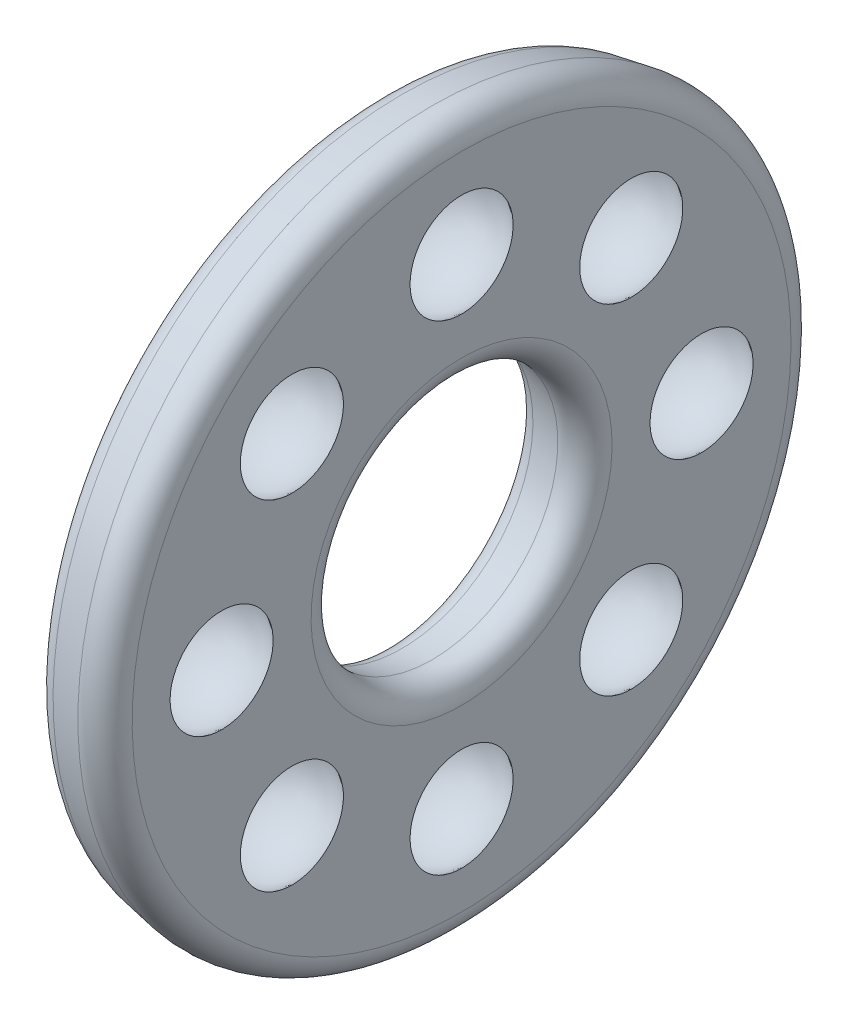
ISO-10303-21;
HEADER;
FILE_DESCRIPTION(('STEP AP214'),'2;1');
FILE_NAME('part.step','',(''),(''),'','','');
FILE_SCHEMA(('AUTOMOTIVE_DESIGN { 1 0 10303 214 1 1 1 1 }'));
ENDSEC;
DATA;
#1=APPLICATION_CONTEXT('core data for automotive mechanical design processes');
#2=APPLICATION_PROTOCOL_DEFINITION('international standard','automotive_design',2000,#1);
#3=PRODUCT_CONTEXT('',#1,'mechanical');
#4=PRODUCT('Part','Part','',(#3));
#5=PRODUCT_RELATED_PRODUCT_CATEGORY('part','',(#4));
#6=PRODUCT_DEFINITION_FORMATION('','',#4);
#7=PRODUCT_DEFINITION_CONTEXT('part definition',#1,'design');
#8=PRODUCT_DEFINITION('design','',#6,#7);
#9=PRODUCT_DEFINITION_SHAPE('','',#8);
#10=(LENGTH_UNIT() NAMED_UNIT(*) SI_UNIT(.MILLI.,.METRE.));
#11=(NAMED_UNIT(*) PLANE_ANGLE_UNIT() SI_UNIT($,.RADIAN.));
#12=(NAMED_UNIT(*) SI_UNIT($,.STERADIAN.) SOLID_ANGLE_UNIT());
#13=UNCERTAINTY_MEASURE_WITH_UNIT(LENGTH_MEASURE(1.E-05),#10,'distance_accuracy_value','');
#14=(GEOMETRIC_REPRESENTATION_CONTEXT(3) GLOBAL_UNCERTAINTY_ASSIGNED_CONTEXT((#13)) GLOBAL_UNIT_ASSIGNED_CONTEXT((#10,
#11,#12)) REPRESENTATION_CONTEXT('',''));
#15=CARTESIAN_POINT('',(0.,0.,0.));
#16=DIRECTION('',(0.,0.,1.));
#17=DIRECTION('',(1.,0.,0.));
#18=AXIS2_PLACEMENT_3D('',#15,#16,#17);
#19=CARTESIAN_POINT('',(4.84,10.5,0.));
#20=DIRECTION('',(-1.,0.,0.));
#21=DIRECTION('',(0.,0.,1.));
#22=AXIS2_PLACEMENT_3D('',#19,#20,#21);
#23=PLANE('',#22);
#24=CARTESIAN_POINT('',(4.84,0.,0.));
#25=DIRECTION('',(-1.,0.,0.));
#26=DIRECTION('',(0.,1.,0.));
#27=AXIS2_PLACEMENT_3D('',#24,#25,#26);
#28=CIRCLE('',#27,6.8186805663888);
#29=CARTESIAN_POINT('',(4.84,6.8186805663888,0.));
#30=VERTEX_POINT('',#29);
#31=EDGE_CURVE('E87',#30,#30,#28,.T.);
#32=ORIENTED_EDGE('',*,*,#31,.F.);
#33=EDGE_LOOP('',(#32));
#34=FACE_BOUND('',#33,.T.);
#35=CARTESIAN_POINT('',(4.84,10.5,0.));
#36=DIRECTION('',(1.,0.,0.));
#37=DIRECTION('',(0.,0.,-1.));
#38=AXIS2_PLACEMENT_3D('',#35,#36,#37);
#39=CIRCLE('',#38,2.25432916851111);
#40=CARTESIAN_POINT('',(4.84,10.5,-2.25432916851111));
#41=VERTEX_POINT('',#40);
#42=EDGE_CURVE('E10',#41,#41,#39,.T.);
#43=ORIENTED_EDGE('',*,*,#42,.T.);
#44=EDGE_LOOP('',(#43));
#45=FACE_BOUND('',#44,.T.);
#46=CARTESIAN_POINT('',(4.84,7.42462120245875,-7.42462120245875));
#47=DIRECTION('',(1.,0.,0.));
#48=DIRECTION('',(0.,0.,-1.));
#49=AXIS2_PLACEMENT_3D('',#46,#47,#48);
#50=CIRCLE('',#49,2.25432916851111);
#51=CARTESIAN_POINT('',(4.84,7.42462120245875,-9.67895037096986));
#52=VERTEX_POINT('',#51);
#53=EDGE_CURVE('E25',#52,#52,#50,.T.);
#54=ORIENTED_EDGE('',*,*,#53,.T.);
#55=EDGE_LOOP('',(#54));
#56=FACE_BOUND('',#55,.T.);
#57=CARTESIAN_POINT('',(4.84,0.,-10.5));
#58=DIRECTION('',(1.,0.,0.));
#59=DIRECTION('',(0.,0.,-1.));
#60=AXIS2_PLACEMENT_3D('',#57,#58,#59);
#61=CIRCLE('',#60,2.25432916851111);
#62=CARTESIAN_POINT('',(4.84,0.,-12.7543291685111));
#63=VERTEX_POINT('',#62);
#64=EDGE_CURVE('E124',#63,#63,#61,.T.);
#65=ORIENTED_EDGE('',*,*,#64,.T.);
#66=EDGE_LOOP('',(#65));
#67=FACE_BOUND('',#66,.T.);
#68=CARTESIAN_POINT('',(4.84,-7.42462120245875,-7.42462120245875));
#69=DIRECTION('',(1.,0.,0.));
#70=DIRECTION('',(0.,0.,-1.));
#71=AXIS2_PLACEMENT_3D('',#68,#69,#70);
#72=CIRCLE('',#71,2.25432916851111);
#73=CARTESIAN_POINT('',(4.84,-7.42462120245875,-9.67895037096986));
#74=VERTEX_POINT('',#73);
#75=EDGE_CURVE('E121',#74,#74,#72,.T.);
#76=ORIENTED_EDGE('',*,*,#75,.T.);
#77=EDGE_LOOP('',(#76));
#78=FACE_BOUND('',#77,.T.);
#79=CARTESIAN_POINT('',(4.84,-10.5,0.));
#80=DIRECTION('',(1.,0.,0.));
#81=DIRECTION('',(0.,0.,-1.));
#82=AXIS2_PLACEMENT_3D('',#79,#80,#81);
#83=CIRCLE('',#82,2.25432916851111);
#84=CARTESIAN_POINT('',(4.84,-10.5,-2.25432916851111));
#85=VERTEX_POINT('',#84);
#86=EDGE_CURVE('E125',#85,#85,#83,.T.);
#87=ORIENTED_EDGE('',*,*,#86,.T.);
#88=EDGE_LOOP('',(#87));
#89=FACE_BOUND('',#88,.T.);
#90=CARTESIAN_POINT('',(4.84,-7.42462120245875,7.42462120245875));
#91=DIRECTION('',(1.,0.,0.));
#92=DIRECTION('',(0.,0.,-1.));
#93=AXIS2_PLACEMENT_3D('',#90,#91,#92);
#94=CIRCLE('',#93,2.25432916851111);
#95=CARTESIAN_POINT('',(4.84,-7.42462120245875,5.17029203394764));
#96=VERTEX_POINT('',#95);
#97=EDGE_CURVE('E231',#96,#96,#94,.T.);
#98=ORIENTED_EDGE('',*,*,#97,.T.);
#99=EDGE_LOOP('',(#98));
#100=FACE_BOUND('',#99,.T.);
#101=CARTESIAN_POINT('',(4.84,0.,10.5));
#102=DIRECTION('',(1.,0.,0.));
#103=DIRECTION('',(0.,0.,-1.));
#104=AXIS2_PLACEMENT_3D('',#101,#102,#103);
#105=CIRCLE('',#104,2.25432916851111);
#106=CARTESIAN_POINT('',(4.84,0.,8.24567083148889));
#107=VERTEX_POINT('',#106);
#108=EDGE_CURVE('E235',#107,#107,#105,.T.);
#109=ORIENTED_EDGE('',*,*,#108,.T.);
#110=EDGE_LOOP('',(#109));
#111=FACE_BOUND('',#110,.T.);
#112=CARTESIAN_POINT('',(4.84,7.42462120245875,7.42462120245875));
#113=DIRECTION('',(1.,0.,0.));
#114=DIRECTION('',(0.,0.,-1.));
#115=AXIS2_PLACEMENT_3D('',#112,#113,#114);
#116=CIRCLE('',#115,2.25432916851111);
#117=CARTESIAN_POINT('',(4.84,7.42462120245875,5.17029203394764));
#118=VERTEX_POINT('',#117);
#119=EDGE_CURVE('E97',#118,#118,#116,.T.);
#120=ORIENTED_EDGE('',*,*,#119,.T.);
#121=EDGE_LOOP('',(#120));
#122=FACE_BOUND('',#121,.T.);
#123=CARTESIAN_POINT('',(4.84,0.,0.));
#124=DIRECTION('',(-1.,0.,0.));
#125=DIRECTION('',(0.,1.,0.));
#126=AXIS2_PLACEMENT_3D('',#123,#124,#125);
#127=CIRCLE('',#126,14.1813194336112);
#128=CARTESIAN_POINT('',(4.84,14.1813194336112,0.));
#129=VERTEX_POINT('',#128);
#130=EDGE_CURVE('E117',#129,#129,#127,.T.);
#131=ORIENTED_EDGE('',*,*,#130,.T.);
#132=EDGE_LOOP('',(#131));
#133=FACE_BOUND('',#132,.T.);
#134=ADVANCED_FACE('F16',(#34,#45,#56,#67,#78,#89,#100,#111,#122,#133),#23,.T.);
#135=CARTESIAN_POINT('',(8.36,10.5,0.));
#136=DIRECTION('',(1.,0.,0.));
#137=DIRECTION('',(0.,0.,-1.));
#138=AXIS2_PLACEMENT_3D('',#135,#136,#137);
#139=PLANE('',#138);
#140=CARTESIAN_POINT('',(8.36,0.,0.));
#141=DIRECTION('',(-1.,0.,0.));
#142=DIRECTION('',(0.,1.,0.));
#143=AXIS2_PLACEMENT_3D('',#140,#141,#142);
#144=CIRCLE('',#143,6.58592895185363);
#145=CARTESIAN_POINT('',(8.36,6.58592895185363,0.));
#146=VERTEX_POINT('',#145);
#147=EDGE_CURVE('E120',#146,#146,#144,.T.);
#148=ORIENTED_EDGE('',*,*,#147,.T.);
#149=EDGE_LOOP('',(#148));
#150=FACE_BOUND('',#149,.T.);
#151=CARTESIAN_POINT('',(8.36,10.5,0.));
#152=DIRECTION('',(-1.,0.,0.));
#153=DIRECTION('',(0.,0.,1.));
#154=AXIS2_PLACEMENT_3D('',#151,#152,#153);
#155=CIRCLE('',#154,2.25432916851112);
#156=CARTESIAN_POINT('',(8.36,10.5,2.25432916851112));
#157=VERTEX_POINT('',#156);
#158=EDGE_CURVE('E115',#157,#157,#155,.T.);
#159=ORIENTED_EDGE('',*,*,#158,.T.);
#160=EDGE_LOOP('',(#159));
#161=FACE_BOUND('',#160,.T.);
#162=CARTESIAN_POINT('',(8.36,7.42462120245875,-7.42462120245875));
#163=DIRECTION('',(-1.,0.,0.));
#164=DIRECTION('',(0.,0.,1.));
#165=AXIS2_PLACEMENT_3D('',#162,#163,#164);
#166=CIRCLE('',#165,2.25432916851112);
#167=CARTESIAN_POINT('',(8.36,7.42462120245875,-5.17029203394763));
#168=VERTEX_POINT('',#167);
#169=EDGE_CURVE('E108',#168,#168,#166,.T.);
#170=ORIENTED_EDGE('',*,*,#169,.T.);
#171=EDGE_LOOP('',(#170));
#172=FACE_BOUND('',#171,.T.);
#173=CARTESIAN_POINT('',(8.36,0.,-10.5));
#174=DIRECTION('',(-1.,0.,0.));
#175=DIRECTION('',(0.,0.,1.));
#176=AXIS2_PLACEMENT_3D('',#173,#174,#175);
#177=CIRCLE('',#176,2.25432916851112);
#178=CARTESIAN_POINT('',(8.36,0.,-8.24567083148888));
#179=VERTEX_POINT('',#178);
#180=EDGE_CURVE('E106',#179,#179,#177,.T.);
#181=ORIENTED_EDGE('',*,*,#180,.T.);
#182=EDGE_LOOP('',(#181));
#183=FACE_BOUND('',#182,.T.);
#184=CARTESIAN_POINT('',(8.36,-7.42462120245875,-7.42462120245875));
#185=DIRECTION('',(-1.,0.,0.));
#186=DIRECTION('',(0.,0.,1.));
#187=AXIS2_PLACEMENT_3D('',#184,#185,#186);
#188=CIRCLE('',#187,2.25432916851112);
#189=CARTESIAN_POINT('',(8.36,-7.42462120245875,-5.17029203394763));
#190=VERTEX_POINT('',#189);
#191=EDGE_CURVE('E109',#190,#190,#188,.T.);
#192=ORIENTED_EDGE('',*,*,#191,.T.);
#193=EDGE_LOOP('',(#192));
#194=FACE_BOUND('',#193,.T.);
#195=CARTESIAN_POINT('',(8.36,-10.5,0.));
#196=DIRECTION('',(-1.,0.,0.));
#197=DIRECTION('',(0.,0.,1.));
#198=AXIS2_PLACEMENT_3D('',#195,#196,#197);
#199=CIRCLE('',#198,2.25432916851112);
#200=CARTESIAN_POINT('',(8.36,-10.5,2.25432916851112));
#201=VERTEX_POINT('',#200);
#202=EDGE_CURVE('E113',#201,#201,#199,.T.);
#203=ORIENTED_EDGE('',*,*,#202,.T.);
#204=EDGE_LOOP('',(#203));
#205=FACE_BOUND('',#204,.T.);
#206=CARTESIAN_POINT('',(8.36,-7.42462120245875,7.42462120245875));
#207=DIRECTION('',(-1.,0.,0.));
#208=DIRECTION('',(0.,0.,1.));
#209=AXIS2_PLACEMENT_3D('',#206,#207,#208);
#210=CIRCLE('',#209,2.25432916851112);
#211=CARTESIAN_POINT('',(8.36,-7.42462120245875,9.67895037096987));
#212=VERTEX_POINT('',#211);
#213=EDGE_CURVE('E90',#212,#212,#210,.T.);
#214=ORIENTED_EDGE('',*,*,#213,.T.);
#215=EDGE_LOOP('',(#214));
#216=FACE_BOUND('',#215,.T.);
#217=CARTESIAN_POINT('',(8.36,0.,10.5));
#218=DIRECTION('',(-1.,0.,0.));
#219=DIRECTION('',(0.,0.,1.));
#220=AXIS2_PLACEMENT_3D('',#217,#218,#219);
#221=CIRCLE('',#220,2.25432916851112);
#222=CARTESIAN_POINT('',(8.36,0.,12.7543291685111));
#223=VERTEX_POINT('',#222);
#224=EDGE_CURVE('E86',#223,#223,#221,.T.);
#225=ORIENTED_EDGE('',*,*,#224,.T.);
#226=EDGE_LOOP('',(#225));
#227=FACE_BOUND('',#226,.T.);
#228=CARTESIAN_POINT('',(8.36,7.42462120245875,7.42462120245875));
#229=DIRECTION('',(-1.,0.,0.));
#230=DIRECTION('',(0.,0.,1.));
#231=AXIS2_PLACEMENT_3D('',#228,#229,#230);
#232=CIRCLE('',#231,2.25432916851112);
#233=CARTESIAN_POINT('',(8.36,7.42462120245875,9.67895037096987));
#234=VERTEX_POINT('',#233);
#235=EDGE_CURVE('E84',#234,#234,#232,.T.);
#236=ORIENTED_EDGE('',*,*,#235,.T.);
#237=EDGE_LOOP('',(#236));
#238=FACE_BOUND('',#237,.T.);
#239=CARTESIAN_POINT('',(8.36,0.,0.));
#240=DIRECTION('',(-1.,0.,0.));
#241=DIRECTION('',(0.,1.,0.));
#242=AXIS2_PLACEMENT_3D('',#239,#240,#241);
#243=CIRCLE('',#242,14.4140710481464);
#244=CARTESIAN_POINT('',(8.36,14.4140710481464,0.));
#245=VERTEX_POINT('',#244);
#246=EDGE_CURVE('E105',#245,#245,#243,.T.);
#247=ORIENTED_EDGE('',*,*,#246,.F.);
#248=EDGE_LOOP('',(#247));
#249=FACE_BOUND('',#248,.T.);
#250=ADVANCED_FACE('F79',(#150,#161,#172,#183,#194,#205,#216,#227,#238,#249),#139,.T.);
#251=CARTESIAN_POINT('',(6.6,7.42462120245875,7.42462120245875));
#252=DIRECTION('',(0.240607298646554,0.54545771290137,0.802859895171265));
#253=DIRECTION('',(-0.956336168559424,-0.0081725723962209,0.292154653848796));
#254=AXIS2_PLACEMENT_3D('',#251,#252,#253);
#255=SPHERICAL_SURFACE('',#254,2.86);
#256=ORIENTED_EDGE('',*,*,#119,.F.);
#257=EDGE_LOOP('',(#256));
#258=FACE_BOUND('',#257,.T.);
#259=CARTESIAN_POINT('',(5.91186312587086,5.86461214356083,5.12844190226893));
#260=VERTEX_POINT('',#259);
#261=VERTEX_LOOP('',#260);
#262=FACE_BOUND('',#261,.T.);
#263=ORIENTED_EDGE('',*,*,#235,.F.);
#264=EDGE_LOOP('',(#263));
#265=FACE_BOUND('',#264,.T.);
#266=CARTESIAN_POINT('',(7.28813687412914,8.98463026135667,9.72080050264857));
#267=VERTEX_POINT('',#266);
#268=VERTEX_LOOP('',#267);
#269=FACE_BOUND('',#268,.T.);
#270=ADVANCED_FACE('F75',(#258,#262,#265,#269),#255,.F.);
#271=CARTESIAN_POINT('',(6.6,0.,10.5));
#272=DIRECTION('',(0.240607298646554,0.54545771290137,0.802859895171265));
#273=DIRECTION('',(-0.956336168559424,-0.0081725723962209,0.292154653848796));
#274=AXIS2_PLACEMENT_3D('',#271,#272,#273);
#275=SPHERICAL_SURFACE('',#274,2.86);
#276=ORIENTED_EDGE('',*,*,#108,.F.);
#277=EDGE_LOOP('',(#276));
#278=FACE_BOUND('',#277,.T.);
#279=CARTESIAN_POINT('',(5.91186312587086,-1.56000905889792,8.20382069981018));
#280=VERTEX_POINT('',#279);
#281=VERTEX_LOOP('',#280);
#282=FACE_BOUND('',#281,.T.);
#283=ORIENTED_EDGE('',*,*,#224,.F.);
#284=EDGE_LOOP('',(#283));
#285=FACE_BOUND('',#284,.T.);
#286=CARTESIAN_POINT('',(7.28813687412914,1.56000905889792,12.7961793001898));
#287=VERTEX_POINT('',#286);
#288=VERTEX_LOOP('',#287);
#289=FACE_BOUND('',#288,.T.);
#290=ADVANCED_FACE('F78',(#278,#282,#285,#289),#275,.F.);
#291=CARTESIAN_POINT('',(6.6,-7.42462120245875,7.42462120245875));
#292=DIRECTION('',(0.240607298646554,0.54545771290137,0.802859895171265));
#293=DIRECTION('',(-0.956336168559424,-0.0081725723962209,0.292154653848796));
#294=AXIS2_PLACEMENT_3D('',#291,#292,#293);
#295=SPHERICAL_SURFACE('',#294,2.86);
#296=ORIENTED_EDGE('',*,*,#97,.F.);
#297=EDGE_LOOP('',(#296));
#298=FACE_BOUND('',#297,.T.);
#299=CARTESIAN_POINT('',(5.91186312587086,-8.98463026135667,5.12844190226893));
#300=VERTEX_POINT('',#299);
#301=VERTEX_LOOP('',#300);
#302=FACE_BOUND('',#301,.T.);
#303=ORIENTED_EDGE('',*,*,#213,.F.);
#304=EDGE_LOOP('',(#303));
#305=FACE_BOUND('',#304,.T.);
#306=CARTESIAN_POINT('',(7.28813687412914,-5.86461214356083,9.72080050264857));
#307=VERTEX_POINT('',#306);
#308=VERTEX_LOOP('',#307);
#309=FACE_BOUND('',#308,.T.);
#310=ADVANCED_FACE('F142',(#298,#302,#305,#309),#295,.F.);
#311=CARTESIAN_POINT('',(6.6,-10.5,0.));
#312=DIRECTION('',(0.240607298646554,0.54545771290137,0.802859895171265));
#313=DIRECTION('',(-0.956336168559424,-0.0081725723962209,0.292154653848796));
#314=AXIS2_PLACEMENT_3D('',#311,#312,#313);
#315=SPHERICAL_SURFACE('',#314,2.86);
#316=ORIENTED_EDGE('',*,*,#86,.F.);
#317=EDGE_LOOP('',(#316));
#318=FACE_BOUND('',#317,.T.);
#319=CARTESIAN_POINT('',(5.91186312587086,-12.0600090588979,-2.29617930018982));
#320=VERTEX_POINT('',#319);
#321=VERTEX_LOOP('',#320);
#322=FACE_BOUND('',#321,.T.);
#323=ORIENTED_EDGE('',*,*,#202,.F.);
#324=EDGE_LOOP('',(#323));
#325=FACE_BOUND('',#324,.T.);
#326=CARTESIAN_POINT('',(7.28813687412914,-8.93999094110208,2.29617930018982));
#327=VERTEX_POINT('',#326);
#328=VERTEX_LOOP('',#327);
#329=FACE_BOUND('',#328,.T.);
#330=ADVANCED_FACE('F146',(#318,#322,#325,#329),#315,.F.);
#331=CARTESIAN_POINT('',(6.6,-7.42462120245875,-7.42462120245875));
#332=DIRECTION('',(0.240607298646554,0.54545771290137,0.802859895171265));
#333=DIRECTION('',(-0.956336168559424,-0.0081725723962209,0.292154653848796));
#334=AXIS2_PLACEMENT_3D('',#331,#332,#333);
#335=SPHERICAL_SURFACE('',#334,2.86);
#336=ORIENTED_EDGE('',*,*,#75,.F.);
#337=EDGE_LOOP('',(#336));
#338=FACE_BOUND('',#337,.T.);
#339=CARTESIAN_POINT('',(5.91186312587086,-8.98463026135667,-9.72080050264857));
#340=VERTEX_POINT('',#339);
#341=VERTEX_LOOP('',#340);
#342=FACE_BOUND('',#341,.T.);
#343=ORIENTED_EDGE('',*,*,#191,.F.);
#344=EDGE_LOOP('',(#343));
#345=FACE_BOUND('',#344,.T.);
#346=CARTESIAN_POINT('',(7.28813687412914,-5.86461214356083,-5.12844190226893));
#347=VERTEX_POINT('',#346);
#348=VERTEX_LOOP('',#347);
#349=FACE_BOUND('',#348,.T.);
#350=ADVANCED_FACE('F157',(#338,#342,#345,#349),#335,.F.);
#351=CARTESIAN_POINT('',(6.6,0.,-10.5));
#352=DIRECTION('',(0.240607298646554,0.54545771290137,0.802859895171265));
#353=DIRECTION('',(-0.956336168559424,-0.0081725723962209,0.292154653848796));
#354=AXIS2_PLACEMENT_3D('',#351,#352,#353);
#355=SPHERICAL_SURFACE('',#354,2.86);
#356=ORIENTED_EDGE('',*,*,#64,.F.);
#357=EDGE_LOOP('',(#356));
#358=FACE_BOUND('',#357,.T.);
#359=CARTESIAN_POINT('',(5.91186312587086,-1.56000905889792,-12.7961793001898));
#360=VERTEX_POINT('',#359);
#361=VERTEX_LOOP('',#360);
#362=FACE_BOUND('',#361,.T.);
#363=ORIENTED_EDGE('',*,*,#180,.F.);
#364=EDGE_LOOP('',(#363));
#365=FACE_BOUND('',#364,.T.);
#366=CARTESIAN_POINT('',(7.28813687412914,1.56000905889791,-8.20382069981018));
#367=VERTEX_POINT('',#366);
#368=VERTEX_LOOP('',#367);
#369=FACE_BOUND('',#368,.T.);
#370=ADVANCED_FACE('F160',(#358,#362,#365,#369),#355,.F.);
#371=CARTESIAN_POINT('',(6.6,7.42462120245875,-7.42462120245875));
#372=DIRECTION('',(0.240607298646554,0.54545771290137,0.802859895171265));
#373=DIRECTION('',(-0.956336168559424,-0.0081725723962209,0.292154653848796));
#374=AXIS2_PLACEMENT_3D('',#371,#372,#373);
#375=SPHERICAL_SURFACE('',#374,2.86);
#376=ORIENTED_EDGE('',*,*,#53,.F.);
#377=EDGE_LOOP('',(#376));
#378=FACE_BOUND('',#377,.T.);
#379=CARTESIAN_POINT('',(5.91186312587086,5.86461214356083,-9.72080050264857));
#380=VERTEX_POINT('',#379);
#381=VERTEX_LOOP('',#380);
#382=FACE_BOUND('',#381,.T.);
#383=ORIENTED_EDGE('',*,*,#169,.F.);
#384=EDGE_LOOP('',(#383));
#385=FACE_BOUND('',#384,.T.);
#386=CARTESIAN_POINT('',(7.28813687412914,8.98463026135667,-5.12844190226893));
#387=VERTEX_POINT('',#386);
#388=VERTEX_LOOP('',#387);
#389=FACE_BOUND('',#388,.T.);
#390=ADVANCED_FACE('F164',(#378,#382,#385,#389),#375,.F.);
#391=CARTESIAN_POINT('',(6.6,10.5,0.));
#392=DIRECTION('',(0.240607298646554,0.54545771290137,0.802859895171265));
#393=DIRECTION('',(-0.956336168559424,-0.0081725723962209,0.292154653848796));
#394=AXIS2_PLACEMENT_3D('',#391,#392,#393);
#395=SPHERICAL_SURFACE('',#394,2.86);
#396=ORIENTED_EDGE('',*,*,#42,.F.);
#397=EDGE_LOOP('',(#396));
#398=FACE_BOUND('',#397,.T.);
#399=CARTESIAN_POINT('',(5.91186312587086,8.93999094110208,-2.29617930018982));
#400=VERTEX_POINT('',#399);
#401=VERTEX_LOOP('',#400);
#402=FACE_BOUND('',#401,.T.);
#403=ORIENTED_EDGE('',*,*,#158,.F.);
#404=EDGE_LOOP('',(#403));
#405=FACE_BOUND('',#404,.T.);
#406=CARTESIAN_POINT('',(7.28813687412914,12.0600090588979,2.29617930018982));
#407=VERTEX_POINT('',#406);
#408=VERTEX_LOOP('',#407);
#409=FACE_BOUND('',#408,.T.);
#410=ADVANCED_FACE('F168',(#398,#402,#405,#409),#395,.F.);
#411=CARTESIAN_POINT('',(5.94,0.,0.));
#412=DIRECTION('',(-1.,0.,0.));
#413=DIRECTION('',(0.,0.,1.));
#414=AXIS2_PLACEMENT_3D('',#411,#412,#413);
#415=TOROIDAL_SURFACE('',#414,6.8186805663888,1.1);
#416=ORIENTED_EDGE('',*,*,#31,.T.);
#417=EDGE_LOOP('',(#416));
#418=FACE_BOUND('',#417,.T.);
#419=CARTESIAN_POINT('',(5.74898700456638,0.,0.));
#420=DIRECTION('',(-1.,0.,0.));
#421=DIRECTION('',(0.,1.,0.));
#422=AXIS2_PLACEMENT_3D('',#419,#420,#421);
#423=CIRCLE('',#422,5.73539203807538);
#424=CARTESIAN_POINT('',(5.74898700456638,5.73539203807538,0.));
#425=VERTEX_POINT('',#424);
#426=EDGE_CURVE('E93',#425,#425,#423,.T.);
#427=ORIENTED_EDGE('',*,*,#426,.F.);
#428=EDGE_LOOP('',(#427));
#429=FACE_BOUND('',#428,.T.);
#430=ADVANCED_FACE('F179',(#418,#429),#415,.T.);
#431=DIRECTION('',(-0.984807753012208,0.17364817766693,0.));
#432=VECTOR('',#431,1.);
#433=CARTESIAN_POINT('',(-499000.,87993.9124670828,-2.15515808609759E-11));
#434=LINE('',#433,#432);
#435=CARTESIAN_POINT('',(38.2760115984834,0.,0.));
#436=DIRECTION('',(-1.,0.,0.));
#437=AXIS1_PLACEMENT('',#435,#436);
#438=SURFACE_OF_REVOLUTION('',#434,#437);
#439=ORIENTED_EDGE('',*,*,#426,.T.);
#440=EDGE_LOOP('',(#439));
#441=FACE_BOUND('',#440,.T.);
#442=CARTESIAN_POINT('',(7.06898700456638,0.,0.));
#443=DIRECTION('',(-1.,0.,0.));
#444=DIRECTION('',(0.,1.,0.));
#445=AXIS2_PLACEMENT_3D('',#442,#443,#444);
#446=CIRCLE('',#445,5.5026404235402);
#447=CARTESIAN_POINT('',(7.06898700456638,5.5026404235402,0.));
#448=VERTEX_POINT('',#447);
#449=EDGE_CURVE('E102',#448,#448,#446,.T.);
#450=ORIENTED_EDGE('',*,*,#449,.F.);
#451=EDGE_LOOP('',(#450));
#452=FACE_BOUND('',#451,.T.);
#453=ADVANCED_FACE('F182',(#441,#452),#438,.F.);
#454=DIRECTION('',(-0.984807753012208,-0.17364817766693,0.));
#455=VECTOR('',#454,1.);
#456=CARTESIAN_POINT('',(6.40898700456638,15.3809837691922,0.));
#457=LINE('',#456,#455);
#458=CARTESIAN_POINT('',(-80.8209066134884,0.,0.));
#459=DIRECTION('',(1.,0.,0.));
#460=AXIS1_PLACEMENT('',#458,#459);
#461=SURFACE_OF_REVOLUTION('',#457,#460);
#462=CARTESIAN_POINT('',(5.74898700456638,0.,0.));
#463=DIRECTION('',(-1.,0.,0.));
#464=DIRECTION('',(0.,1.,0.));
#465=AXIS2_PLACEMENT_3D('',#462,#463,#464);
#466=CIRCLE('',#465,15.2646079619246);
#467=CARTESIAN_POINT('',(5.74898700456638,15.2646079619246,0.));
#468=VERTEX_POINT('',#467);
#469=EDGE_CURVE('E101',#468,#468,#466,.T.);
#470=ORIENTED_EDGE('',*,*,#469,.F.);
#471=EDGE_LOOP('',(#470));
#472=FACE_BOUND('',#471,.T.);
#473=CARTESIAN_POINT('',(7.06898700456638,0.,0.));
#474=DIRECTION('',(-1.,0.,0.));
#475=DIRECTION('',(0.,1.,0.));
#476=AXIS2_PLACEMENT_3D('',#473,#474,#475);
#477=CIRCLE('',#476,15.4973595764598);
#478=CARTESIAN_POINT('',(7.06898700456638,15.4973595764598,0.));
#479=VERTEX_POINT('',#478);
#480=EDGE_CURVE('E128',#479,#479,#477,.T.);
#481=ORIENTED_EDGE('',*,*,#480,.T.);
#482=EDGE_LOOP('',(#481));
#483=FACE_BOUND('',#482,.T.);
#484=ADVANCED_FACE('F186',(#472,#483),#461,.F.);
#485=CARTESIAN_POINT('',(5.94,0.,0.));
#486=DIRECTION('',(-1.,0.,0.));
#487=DIRECTION('',(0.,0.,1.));
#488=AXIS2_PLACEMENT_3D('',#485,#486,#487);
#489=TOROIDAL_SURFACE('',#488,14.1813194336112,1.1);
#490=ORIENTED_EDGE('',*,*,#469,.T.);
#491=EDGE_LOOP('',(#490));
#492=FACE_BOUND('',#491,.T.);
#493=ORIENTED_EDGE('',*,*,#130,.F.);
#494=EDGE_LOOP('',(#493));
#495=FACE_BOUND('',#494,.T.);
#496=ADVANCED_FACE('F190',(#492,#495),#489,.T.);
#497=CARTESIAN_POINT('',(7.26,0.,0.));
#498=DIRECTION('',(-1.,0.,0.));
#499=DIRECTION('',(0.,0.,1.));
#500=AXIS2_PLACEMENT_3D('',#497,#498,#499);
#501=TOROIDAL_SURFACE('',#500,6.58592895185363,1.1);
#502=ORIENTED_EDGE('',*,*,#147,.F.);
#503=EDGE_LOOP('',(#502));
#504=FACE_BOUND('',#503,.T.);
#505=ORIENTED_EDGE('',*,*,#449,.T.);
#506=EDGE_LOOP('',(#505));
#507=FACE_BOUND('',#506,.T.);
#508=ADVANCED_FACE('F196',(#504,#507),#501,.T.);
#509=CARTESIAN_POINT('',(7.26,0.,0.));
#510=DIRECTION('',(-1.,0.,0.));
#511=DIRECTION('',(0.,0.,1.));
#512=AXIS2_PLACEMENT_3D('',#509,#510,#511);
#513=TOROIDAL_SURFACE('',#512,14.4140710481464,1.1);
#514=ORIENTED_EDGE('',*,*,#246,.T.);
#515=EDGE_LOOP('',(#514));
#516=FACE_BOUND('',#515,.T.);
#517=ORIENTED_EDGE('',*,*,#480,.F.);
#518=EDGE_LOOP('',(#517));
#519=FACE_BOUND('',#518,.T.);
#520=ADVANCED_FACE('F18',(#516,#519),#513,.T.);
#521=CLOSED_SHELL('',(#134,#250,#270,#290,#310,#330,#350,#370,#390,#410,#430,#453,#484,#496,
#508,#520));
#522=MANIFOLD_SOLID_BREP('B1',#521);
#523=ADVANCED_BREP_SHAPE_REPRESENTATION('',(#18,#522),#14);
#524=SHAPE_DEFINITION_REPRESENTATION(#9,#523);
ENDSEC;
END-ISO-10303-21;
